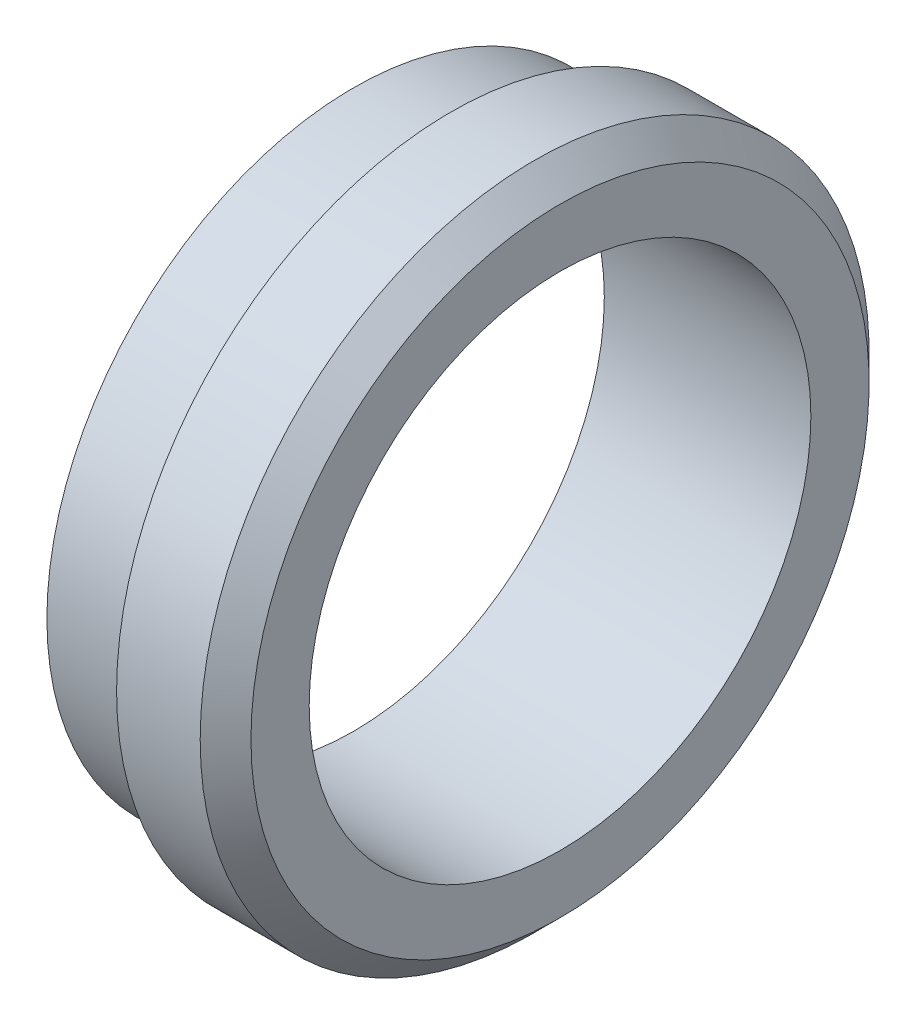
ISO-10303-21;
HEADER;
FILE_DESCRIPTION(('STEP AP214'),'2;1');
FILE_NAME('part.step','',(''),(''),'','','');
FILE_SCHEMA(('AUTOMOTIVE_DESIGN { 1 0 10303 214 1 1 1 1 }'));
ENDSEC;
DATA;
#1=APPLICATION_CONTEXT('core data for automotive mechanical design processes');
#2=APPLICATION_PROTOCOL_DEFINITION('international standard','automotive_design',2000,#1);
#3=PRODUCT_CONTEXT('',#1,'mechanical');
#4=PRODUCT('Part','Part','',(#3));
#5=PRODUCT_RELATED_PRODUCT_CATEGORY('part','',(#4));
#6=PRODUCT_DEFINITION_FORMATION('','',#4);
#7=PRODUCT_DEFINITION_CONTEXT('part definition',#1,'design');
#8=PRODUCT_DEFINITION('design','',#6,#7);
#9=PRODUCT_DEFINITION_SHAPE('','',#8);
#10=(LENGTH_UNIT() NAMED_UNIT(*) SI_UNIT(.MILLI.,.METRE.));
#11=(NAMED_UNIT(*) PLANE_ANGLE_UNIT() SI_UNIT($,.RADIAN.));
#12=(NAMED_UNIT(*) SI_UNIT($,.STERADIAN.) SOLID_ANGLE_UNIT());
#13=UNCERTAINTY_MEASURE_WITH_UNIT(LENGTH_MEASURE(1.E-05),#10,'distance_accuracy_value','');
#14=(GEOMETRIC_REPRESENTATION_CONTEXT(3) GLOBAL_UNCERTAINTY_ASSIGNED_CONTEXT((#13)) GLOBAL_UNIT_ASSIGNED_CONTEXT((#10,
#11,#12)) REPRESENTATION_CONTEXT('',''));
#15=CARTESIAN_POINT('',(0.,0.,0.));
#16=DIRECTION('',(0.,0.,1.));
#17=DIRECTION('',(1.,0.,0.));
#18=AXIS2_PLACEMENT_3D('',#15,#16,#17);
#19=CARTESIAN_POINT('',(-15.7829131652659,-0.999999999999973,0.));
#20=DIRECTION('',(1.,0.,0.));
#21=DIRECTION('',(0.,0.,-1.));
#22=AXIS2_PLACEMENT_3D('',#19,#20,#21);
#23=PLANE('',#22);
#24=CARTESIAN_POINT('',(-15.7829131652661,-20.,1.00575651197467));
#25=DIRECTION('',(-1.,0.,0.));
#26=DIRECTION('',(0.,0.,1.));
#27=AXIS2_PLACEMENT_3D('',#24,#25,#26);
#28=CIRCLE('',#27,0.750000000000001);
#29=CARTESIAN_POINT('',(-15.7829131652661,-20.,1.75575651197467));
#30=VERTEX_POINT('',#29);
#31=EDGE_CURVE('E382',#30,#30,#28,.T.);
#32=ORIENTED_EDGE('',*,*,#31,.F.);
#33=EDGE_LOOP('',(#32));
#34=FACE_BOUND('',#33,.T.);
#35=CARTESIAN_POINT('',(-15.7829131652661,-8.99424348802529,9.99999999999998));
#36=DIRECTION('',(-1.,0.,0.));
#37=DIRECTION('',(0.,0.,1.));
#38=AXIS2_PLACEMENT_3D('',#35,#36,#37);
#39=CIRCLE('',#38,0.749999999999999);
#40=CARTESIAN_POINT('',(-15.7829131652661,-8.99424348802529,10.75));
#41=VERTEX_POINT('',#40);
#42=EDGE_CURVE('E390',#41,#41,#39,.T.);
#43=ORIENTED_EDGE('',*,*,#42,.F.);
#44=EDGE_LOOP('',(#43));
#45=FACE_BOUND('',#44,.T.);
#46=CARTESIAN_POINT('',(-15.7829131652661,0.,-1.00575651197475));
#47=DIRECTION('',(-1.,0.,0.));
#48=DIRECTION('',(0.,0.,1.));
#49=AXIS2_PLACEMENT_3D('',#46,#47,#48);
#50=CIRCLE('',#49,0.75);
#51=CARTESIAN_POINT('',(-15.7829131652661,0.,-0.255756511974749));
#52=VERTEX_POINT('',#51);
#53=EDGE_CURVE('E396',#52,#52,#50,.T.);
#54=ORIENTED_EDGE('',*,*,#53,.F.);
#55=EDGE_LOOP('',(#54));
#56=FACE_BOUND('',#55,.T.);
#57=CARTESIAN_POINT('',(-15.7829131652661,-11.0057565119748,-10.));
#58=DIRECTION('',(-1.,0.,0.));
#59=DIRECTION('',(0.,0.,1.));
#60=AXIS2_PLACEMENT_3D('',#57,#58,#59);
#61=CIRCLE('',#60,0.749999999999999);
#62=CARTESIAN_POINT('',(-15.7829131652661,-11.0057565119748,-9.25));
#63=VERTEX_POINT('',#62);
#64=EDGE_CURVE('E402',#63,#63,#61,.T.);
#65=ORIENTED_EDGE('',*,*,#64,.F.);
#66=EDGE_LOOP('',(#65));
#67=FACE_BOUND('',#66,.T.);
#68=CARTESIAN_POINT('',(-15.7829131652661,-10.,0.));
#69=DIRECTION('',(-1.,0.,0.));
#70=DIRECTION('',(0.,0.,1.));
#71=AXIS2_PLACEMENT_3D('',#68,#69,#70);
#72=CIRCLE('',#71,9.);
#73=CARTESIAN_POINT('',(-15.7829131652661,-10.,9.));
#74=VERTEX_POINT('',#73);
#75=EDGE_CURVE('E405',#74,#74,#72,.T.);
#76=ORIENTED_EDGE('',*,*,#75,.F.);
#77=EDGE_LOOP('',(#76));
#78=FACE_BOUND('',#77,.T.);
#79=CARTESIAN_POINT('',(-15.7829131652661,-10.,0.));
#80=DIRECTION('',(-1.,0.,0.));
#81=DIRECTION('',(0.,0.,1.));
#82=AXIS2_PLACEMENT_3D('',#79,#80,#81);
#83=CIRCLE('',#82,11.);
#84=CARTESIAN_POINT('',(-15.7829131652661,-10.,11.));
#85=VERTEX_POINT('',#84);
#86=EDGE_CURVE('E11',#85,#85,#83,.T.);
#87=ORIENTED_EDGE('',*,*,#86,.T.);
#88=EDGE_LOOP('',(#87));
#89=FACE_BOUND('',#88,.T.);
#90=ADVANCED_FACE('F353',(#34,#45,#56,#67,#78,#89),#23,.F.);
#91=CARTESIAN_POINT('',(-26.2180239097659,-10.,0.));
#92=DIRECTION('',(-1.,0.,0.));
#93=DIRECTION('',(0.,0.,1.));
#94=AXIS2_PLACEMENT_3D('',#91,#92,#93);
#95=CYLINDRICAL_SURFACE('',#94,11.);
#96=ORIENTED_EDGE('',*,*,#86,.F.);
#97=EDGE_LOOP('',(#96));
#98=FACE_BOUND('',#97,.T.);
#99=CARTESIAN_POINT('',(-12.7829131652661,-9.99999999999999,0.));
#100=DIRECTION('',(-1.,0.,0.));
#101=DIRECTION('',(0.,0.,1.));
#102=AXIS2_PLACEMENT_3D('',#99,#100,#101);
#103=CIRCLE('',#102,11.);
#104=CARTESIAN_POINT('',(-12.7829131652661,-9.99999999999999,11.));
#105=VERTEX_POINT('',#104);
#106=EDGE_CURVE('E360',#105,#105,#103,.T.);
#107=ORIENTED_EDGE('',*,*,#106,.T.);
#108=EDGE_LOOP('',(#107));
#109=FACE_BOUND('',#108,.T.);
#110=ADVANCED_FACE('F428',(#98,#109),#95,.T.);
#111=CARTESIAN_POINT('',(-12.7829131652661,1.00000000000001,0.));
#112=DIRECTION('',(-1.,0.,0.));
#113=DIRECTION('',(0.,0.,1.));
#114=AXIS2_PLACEMENT_3D('',#111,#112,#113);
#115=PLANE('',#114);
#116=ORIENTED_EDGE('',*,*,#106,.F.);
#117=EDGE_LOOP('',(#116));
#118=FACE_BOUND('',#117,.T.);
#119=CARTESIAN_POINT('',(-12.7829131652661,-9.99999999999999,0.));
#120=DIRECTION('',(-1.,0.,0.));
#121=DIRECTION('',(0.,0.,1.));
#122=AXIS2_PLACEMENT_3D('',#119,#120,#121);
#123=CIRCLE('',#122,10.5);
#124=CARTESIAN_POINT('',(-12.7829131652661,-9.99999999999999,10.5));
#125=VERTEX_POINT('',#124);
#126=EDGE_CURVE('E423',#125,#125,#123,.T.);
#127=ORIENTED_EDGE('',*,*,#126,.T.);
#128=EDGE_LOOP('',(#127));
#129=FACE_BOUND('',#128,.T.);
#130=ADVANCED_FACE('F430',(#118,#129),#115,.F.);
#131=CARTESIAN_POINT('',(-26.2180239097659,-10.,0.));
#132=DIRECTION('',(-1.,0.,0.));
#133=DIRECTION('',(0.,0.,1.));
#134=AXIS2_PLACEMENT_3D('',#131,#132,#133);
#135=CYLINDRICAL_SURFACE('',#134,10.5);
#136=ORIENTED_EDGE('',*,*,#126,.F.);
#137=EDGE_LOOP('',(#136));
#138=FACE_BOUND('',#137,.T.);
#139=CARTESIAN_POINT('',(-12.2829131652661,-9.99999999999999,0.));
#140=DIRECTION('',(-1.,0.,0.));
#141=DIRECTION('',(0.,0.,1.));
#142=AXIS2_PLACEMENT_3D('',#139,#140,#141);
#143=CIRCLE('',#142,10.5);
#144=CARTESIAN_POINT('',(-12.2829131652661,-10.,10.5));
#145=VERTEX_POINT('',#144);
#146=EDGE_CURVE('E420',#145,#145,#143,.T.);
#147=ORIENTED_EDGE('',*,*,#146,.T.);
#148=EDGE_LOOP('',(#147));
#149=FACE_BOUND('',#148,.T.);
#150=ADVANCED_FACE('F433',(#138,#149),#135,.T.);
#151=CARTESIAN_POINT('',(-12.2829131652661,0.499999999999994,0.));
#152=DIRECTION('',(1.,0.,0.));
#153=DIRECTION('',(0.,0.,-1.));
#154=AXIS2_PLACEMENT_3D('',#151,#152,#153);
#155=PLANE('',#154);
#156=ORIENTED_EDGE('',*,*,#146,.F.);
#157=EDGE_LOOP('',(#156));
#158=FACE_BOUND('',#157,.T.);
#159=CARTESIAN_POINT('',(-12.2829131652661,-9.99999999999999,0.));
#160=DIRECTION('',(-1.,0.,0.));
#161=DIRECTION('',(0.,0.,1.));
#162=AXIS2_PLACEMENT_3D('',#159,#160,#161);
#163=CIRCLE('',#162,12.);
#164=CARTESIAN_POINT('',(-12.2829131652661,-10.,12.));
#165=VERTEX_POINT('',#164);
#166=EDGE_CURVE('E417',#165,#165,#163,.T.);
#167=ORIENTED_EDGE('',*,*,#166,.T.);
#168=EDGE_LOOP('',(#167));
#169=FACE_BOUND('',#168,.T.);
#170=ADVANCED_FACE('F439',(#158,#169),#155,.F.);
#171=CARTESIAN_POINT('',(-26.2180239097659,-10.,0.));
#172=DIRECTION('',(-1.,0.,0.));
#173=DIRECTION('',(0.,0.,1.));
#174=AXIS2_PLACEMENT_3D('',#171,#172,#173);
#175=CYLINDRICAL_SURFACE('',#174,12.);
#176=ORIENTED_EDGE('',*,*,#166,.F.);
#177=EDGE_LOOP('',(#176));
#178=FACE_BOUND('',#177,.T.);
#179=CARTESIAN_POINT('',(-9.28291316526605,-10.,0.));
#180=DIRECTION('',(-1.,0.,0.));
#181=DIRECTION('',(0.,0.,1.));
#182=AXIS2_PLACEMENT_3D('',#179,#180,#181);
#183=CIRCLE('',#182,12.);
#184=CARTESIAN_POINT('',(-9.28291316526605,-10.,12.));
#185=VERTEX_POINT('',#184);
#186=EDGE_CURVE('E414',#185,#185,#183,.T.);
#187=ORIENTED_EDGE('',*,*,#186,.T.);
#188=EDGE_LOOP('',(#187));
#189=FACE_BOUND('',#188,.T.);
#190=ADVANCED_FACE('F445',(#178,#189),#175,.T.);
#191=CARTESIAN_POINT('',(-8.37225299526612,-9.99999999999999,0.));
#192=DIRECTION('',(-1.,0.,0.));
#193=DIRECTION('',(0.,0.,1.));
#194=AXIS2_PLACEMENT_3D('',#191,#192,#193);
#195=CONICAL_SURFACE('',#194,11.08933983,0.78539816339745);
#196=ORIENTED_EDGE('',*,*,#186,.F.);
#197=EDGE_LOOP('',(#196));
#198=FACE_BOUND('',#197,.T.);
#199=CARTESIAN_POINT('',(-8.37225299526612,-9.99999999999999,0.));
#200=DIRECTION('',(-1.,0.,0.));
#201=DIRECTION('',(0.,0.,1.));
#202=AXIS2_PLACEMENT_3D('',#199,#200,#201);
#203=CIRCLE('',#202,11.08933983);
#204=CARTESIAN_POINT('',(-8.37225299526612,-10.,11.08933983));
#205=VERTEX_POINT('',#204);
#206=EDGE_CURVE('E411',#205,#205,#203,.T.);
#207=ORIENTED_EDGE('',*,*,#206,.T.);
#208=EDGE_LOOP('',(#207));
#209=FACE_BOUND('',#208,.T.);
#210=ADVANCED_FACE('F451',(#198,#209),#195,.T.);
#211=CARTESIAN_POINT('',(-8.37225299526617,1.08933983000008,0.));
#212=DIRECTION('',(-1.,0.,0.));
#213=DIRECTION('',(0.,0.,1.));
#214=AXIS2_PLACEMENT_3D('',#211,#212,#213);
#215=PLANE('',#214);
#216=ORIENTED_EDGE('',*,*,#206,.F.);
#217=EDGE_LOOP('',(#216));
#218=FACE_BOUND('',#217,.T.);
#219=CARTESIAN_POINT('',(-8.37225299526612,-9.99999999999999,0.));
#220=DIRECTION('',(-1.,0.,0.));
#221=DIRECTION('',(0.,0.,1.));
#222=AXIS2_PLACEMENT_3D('',#219,#220,#221);
#223=CIRCLE('',#222,9.);
#224=CARTESIAN_POINT('',(-8.37225299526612,-9.99999999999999,9.));
#225=VERTEX_POINT('',#224);
#226=EDGE_CURVE('E408',#225,#225,#223,.T.);
#227=ORIENTED_EDGE('',*,*,#226,.T.);
#228=EDGE_LOOP('',(#227));
#229=FACE_BOUND('',#228,.T.);
#230=ADVANCED_FACE('F457',(#218,#229),#215,.F.);
#231=CARTESIAN_POINT('',(-26.2180239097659,-10.,0.));
#232=DIRECTION('',(-1.,0.,0.));
#233=DIRECTION('',(0.,0.,1.));
#234=AXIS2_PLACEMENT_3D('',#231,#232,#233);
#235=CYLINDRICAL_SURFACE('',#234,9.);
#236=ORIENTED_EDGE('',*,*,#226,.F.);
#237=EDGE_LOOP('',(#236));
#238=FACE_BOUND('',#237,.T.);
#239=ORIENTED_EDGE('',*,*,#75,.T.);
#240=EDGE_LOOP('',(#239));
#241=FACE_BOUND('',#240,.T.);
#242=ADVANCED_FACE('F463',(#238,#241),#235,.F.);
#243=CARTESIAN_POINT('',(-15.7829131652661,-11.0057565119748,-10.));
#244=DIRECTION('',(-1.,0.,0.));
#245=DIRECTION('',(0.,0.,1.));
#246=AXIS2_PLACEMENT_3D('',#243,#244,#245);
#247=CYLINDRICAL_SURFACE('',#246,0.749999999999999);
#248=CARTESIAN_POINT('',(-13.2829131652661,-11.0057565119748,-10.));
#249=DIRECTION('',(-1.,0.,0.));
#250=DIRECTION('',(0.,0.,1.));
#251=AXIS2_PLACEMENT_3D('',#248,#249,#250);
#252=CIRCLE('',#251,0.749999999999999);
#253=CARTESIAN_POINT('',(-13.2829131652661,-11.0057565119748,-9.25));
#254=VERTEX_POINT('',#253);
#255=EDGE_CURVE('E399',#254,#254,#252,.T.);
#256=ORIENTED_EDGE('',*,*,#255,.F.);
#257=EDGE_LOOP('',(#256));
#258=FACE_BOUND('',#257,.T.);
#259=ORIENTED_EDGE('',*,*,#64,.T.);
#260=EDGE_LOOP('',(#259));
#261=FACE_BOUND('',#260,.T.);
#262=ADVANCED_FACE('F469',(#258,#261),#247,.F.);
#263=CARTESIAN_POINT('',(-13.2829131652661,-11.0057565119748,-10.));
#264=DIRECTION('',(-1.,0.,0.));
#265=DIRECTION('',(0.,0.,1.));
#266=AXIS2_PLACEMENT_3D('',#263,#264,#265);
#267=CONICAL_SURFACE('',#266,0.749999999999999,1.02974425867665);
#268=CARTESIAN_POINT('',(-12.8322677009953,-11.0057565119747,-10.));
#269=VERTEX_POINT('',#268);
#270=VERTEX_LOOP('',#269);
#271=FACE_BOUND('',#270,.T.);
#272=ORIENTED_EDGE('',*,*,#255,.T.);
#273=EDGE_LOOP('',(#272));
#274=FACE_BOUND('',#273,.T.);
#275=ADVANCED_FACE('F484',(#271,#274),#267,.F.);
#276=CARTESIAN_POINT('',(-15.7829131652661,0.,-1.00575651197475));
#277=DIRECTION('',(-1.,0.,0.));
#278=DIRECTION('',(0.,0.,1.));
#279=AXIS2_PLACEMENT_3D('',#276,#277,#278);
#280=CYLINDRICAL_SURFACE('',#279,0.75);
#281=CARTESIAN_POINT('',(-13.2829131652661,1.04083408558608E-13,-1.00575651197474));
#282=DIRECTION('',(-1.,0.,0.));
#283=DIRECTION('',(0.,0.,1.));
#284=AXIS2_PLACEMENT_3D('',#281,#282,#283);
#285=CIRCLE('',#284,0.75);
#286=CARTESIAN_POINT('',(-13.2829131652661,1.04011200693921E-13,-0.255756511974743));
#287=VERTEX_POINT('',#286);
#288=EDGE_CURVE('E393',#287,#287,#285,.T.);
#289=ORIENTED_EDGE('',*,*,#288,.F.);
#290=EDGE_LOOP('',(#289));
#291=FACE_BOUND('',#290,.T.);
#292=ORIENTED_EDGE('',*,*,#53,.T.);
#293=EDGE_LOOP('',(#292));
#294=FACE_BOUND('',#293,.T.);
#295=ADVANCED_FACE('F488',(#291,#294),#280,.F.);
#296=CARTESIAN_POINT('',(-13.2829131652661,1.04083408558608E-13,-1.00575651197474));
#297=DIRECTION('',(-1.,0.,0.));
#298=DIRECTION('',(0.,0.,1.));
#299=AXIS2_PLACEMENT_3D('',#296,#297,#298);
#300=CONICAL_SURFACE('',#299,0.75,1.02974425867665);
#301=CARTESIAN_POINT('',(-12.8322677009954,0.,-1.00575651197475));
#302=VERTEX_POINT('',#301);
#303=VERTEX_LOOP('',#302);
#304=FACE_BOUND('',#303,.T.);
#305=ORIENTED_EDGE('',*,*,#288,.T.);
#306=EDGE_LOOP('',(#305));
#307=FACE_BOUND('',#306,.T.);
#308=ADVANCED_FACE('F491',(#304,#307),#300,.F.);
#309=CARTESIAN_POINT('',(-15.7829131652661,-8.99424348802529,9.99999999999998));
#310=DIRECTION('',(-1.,0.,0.));
#311=DIRECTION('',(0.,0.,1.));
#312=AXIS2_PLACEMENT_3D('',#309,#310,#311);
#313=CYLINDRICAL_SURFACE('',#312,0.749999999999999);
#314=CARTESIAN_POINT('',(-13.2829131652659,-8.99424348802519,10.));
#315=DIRECTION('',(-1.,0.,0.));
#316=DIRECTION('',(0.,0.,1.));
#317=AXIS2_PLACEMENT_3D('',#314,#315,#316);
#318=CIRCLE('',#317,0.749999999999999);
#319=CARTESIAN_POINT('',(-13.2829131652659,-8.99424348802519,10.75));
#320=VERTEX_POINT('',#319);
#321=EDGE_CURVE('E385',#320,#320,#318,.T.);
#322=ORIENTED_EDGE('',*,*,#321,.F.);
#323=EDGE_LOOP('',(#322));
#324=FACE_BOUND('',#323,.T.);
#325=ORIENTED_EDGE('',*,*,#42,.T.);
#326=EDGE_LOOP('',(#325));
#327=FACE_BOUND('',#326,.T.);
#328=ADVANCED_FACE('F495',(#324,#327),#313,.F.);
#329=CARTESIAN_POINT('',(-13.2829131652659,-8.99424348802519,10.));
#330=DIRECTION('',(-1.,0.,0.));
#331=DIRECTION('',(0.,0.,1.));
#332=AXIS2_PLACEMENT_3D('',#329,#330,#331);
#333=CONICAL_SURFACE('',#332,0.749999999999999,1.02974425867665);
#334=CARTESIAN_POINT('',(-12.8322677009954,-8.99424348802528,10.));
#335=VERTEX_POINT('',#334);
#336=VERTEX_LOOP('',#335);
#337=FACE_BOUND('',#336,.T.);
#338=ORIENTED_EDGE('',*,*,#321,.T.);
#339=EDGE_LOOP('',(#338));
#340=FACE_BOUND('',#339,.T.);
#341=ADVANCED_FACE('F498',(#337,#340),#333,.F.);
#342=CARTESIAN_POINT('',(-15.7829131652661,-20.,1.00575651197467));
#343=DIRECTION('',(-1.,0.,0.));
#344=DIRECTION('',(0.,0.,1.));
#345=AXIS2_PLACEMENT_3D('',#342,#343,#344);
#346=CYLINDRICAL_SURFACE('',#345,0.750000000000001);
#347=CARTESIAN_POINT('',(-13.2829131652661,-20.,1.00575651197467));
#348=DIRECTION('',(-1.,0.,0.));
#349=DIRECTION('',(0.,0.,1.));
#350=AXIS2_PLACEMENT_3D('',#347,#348,#349);
#351=CIRCLE('',#350,0.750000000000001);
#352=CARTESIAN_POINT('',(-13.2829131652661,-20.,1.75575651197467));
#353=VERTEX_POINT('',#352);
#354=EDGE_CURVE('E380',#353,#353,#351,.T.);
#355=ORIENTED_EDGE('',*,*,#354,.F.);
#356=EDGE_LOOP('',(#355));
#357=FACE_BOUND('',#356,.T.);
#358=ORIENTED_EDGE('',*,*,#31,.T.);
#359=EDGE_LOOP('',(#358));
#360=FACE_BOUND('',#359,.T.);
#361=ADVANCED_FACE('F376',(#357,#360),#346,.F.);
#362=CARTESIAN_POINT('',(-13.2829131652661,-20.,1.00575651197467));
#363=DIRECTION('',(-1.,0.,0.));
#364=DIRECTION('',(0.,0.,1.));
#365=AXIS2_PLACEMENT_3D('',#362,#363,#364);
#366=CONICAL_SURFACE('',#365,0.750000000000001,1.02974425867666);
#367=CARTESIAN_POINT('',(-12.8322677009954,-20.,1.00575651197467));
#368=VERTEX_POINT('',#367);
#369=VERTEX_LOOP('',#368);
#370=FACE_BOUND('',#369,.T.);
#371=ORIENTED_EDGE('',*,*,#354,.T.);
#372=EDGE_LOOP('',(#371));
#373=FACE_BOUND('',#372,.T.);
#374=ADVANCED_FACE('F373',(#370,#373),#366,.F.);
#375=CLOSED_SHELL('',(#90,#110,#130,#150,#170,#190,#210,#230,#242,#262,#275,#295,#308,#328,#341,
#361,#374));
#376=MANIFOLD_SOLID_BREP('B2',#375);
#377=ADVANCED_BREP_SHAPE_REPRESENTATION('',(#18,#376),#14);
#378=SHAPE_DEFINITION_REPRESENTATION(#9,#377);
ENDSEC;
END-ISO-10303-21;
